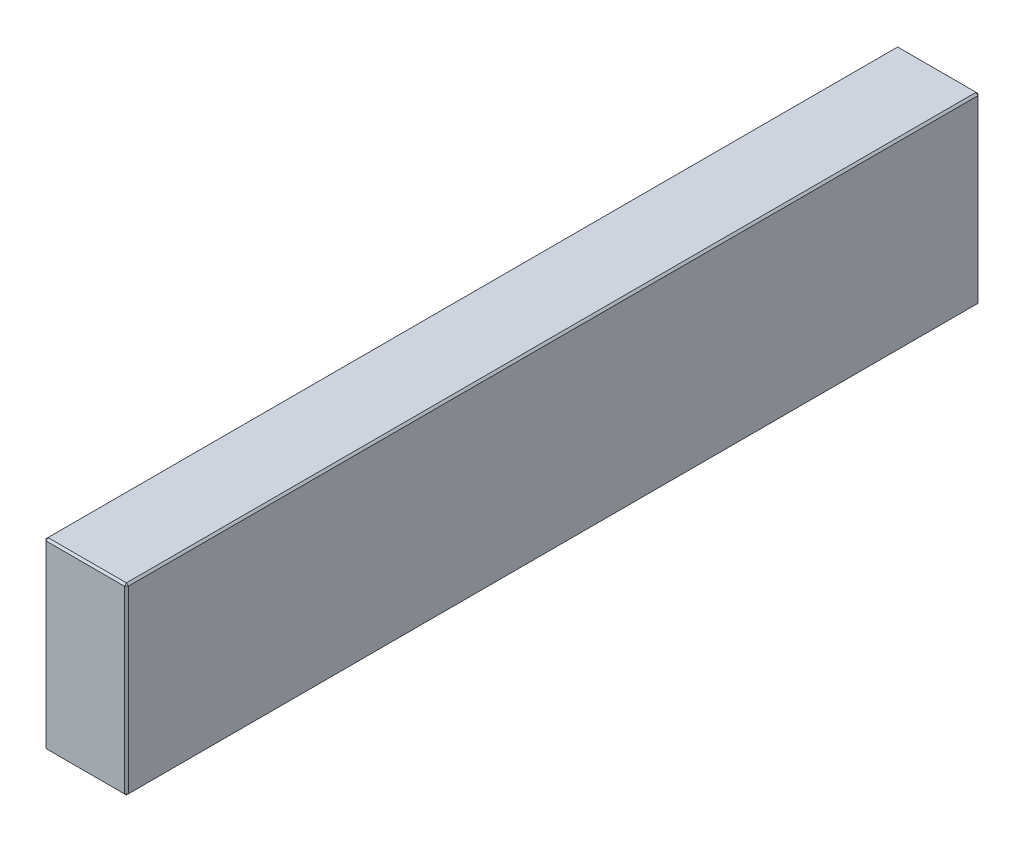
ISO-10303-21;
HEADER;
FILE_DESCRIPTION(('STEP AP214'),'2;1');
FILE_NAME('part.step','',(''),(''),'','','');
FILE_SCHEMA(('AUTOMOTIVE_DESIGN { 1 0 10303 214 1 1 1 1 }'));
ENDSEC;
DATA;
#1=APPLICATION_CONTEXT('core data for automotive mechanical design processes');
#2=APPLICATION_PROTOCOL_DEFINITION('international standard','automotive_design',2000,#1);
#3=PRODUCT_CONTEXT('',#1,'mechanical');
#4=PRODUCT('Part','Part','',(#3));
#5=PRODUCT_RELATED_PRODUCT_CATEGORY('part','',(#4));
#6=PRODUCT_DEFINITION_FORMATION('','',#4);
#7=PRODUCT_DEFINITION_CONTEXT('part definition',#1,'design');
#8=PRODUCT_DEFINITION('design','',#6,#7);
#9=PRODUCT_DEFINITION_SHAPE('','',#8);
#10=(LENGTH_UNIT() NAMED_UNIT(*) SI_UNIT(.MILLI.,.METRE.));
#11=(NAMED_UNIT(*) PLANE_ANGLE_UNIT() SI_UNIT($,.RADIAN.));
#12=(NAMED_UNIT(*) SI_UNIT($,.STERADIAN.) SOLID_ANGLE_UNIT());
#13=UNCERTAINTY_MEASURE_WITH_UNIT(LENGTH_MEASURE(1.E-05),#10,'distance_accuracy_value','');
#14=(GEOMETRIC_REPRESENTATION_CONTEXT(3) GLOBAL_UNCERTAINTY_ASSIGNED_CONTEXT((#13)) GLOBAL_UNIT_ASSIGNED_CONTEXT((#10,
#11,#12)) REPRESENTATION_CONTEXT('',''));
#15=CARTESIAN_POINT('',(0.,0.,0.));
#16=DIRECTION('',(0.,0.,1.));
#17=DIRECTION('',(1.,0.,0.));
#18=AXIS2_PLACEMENT_3D('',#15,#16,#17);
#19=CARTESIAN_POINT('',(-21.5,96.,223.));
#20=DIRECTION('',(1.,0.,0.));
#21=DIRECTION('',(0.,0.,-1.));
#22=AXIS2_PLACEMENT_3D('',#19,#20,#21);
#23=PLANE('',#22);
#24=DIRECTION('',(0.,-1.,0.));
#25=VECTOR('',#24,1.);
#26=CARTESIAN_POINT('',(-21.5,96.,-222.));
#27=LINE('',#26,#25);
#28=CARTESIAN_POINT('',(-21.5,95.,-222.));
#29=VERTEX_POINT('',#28);
#30=CARTESIAN_POINT('',(-21.5,1.00000000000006,-222.));
#31=VERTEX_POINT('',#30);
#32=EDGE_CURVE('E114',#29,#31,#27,.T.);
#33=ORIENTED_EDGE('',*,*,#32,.T.);
#34=DIRECTION('',(0.,0.,1.));
#35=VECTOR('',#34,1.);
#36=CARTESIAN_POINT('',(-21.5,1.00000000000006,223.));
#37=LINE('',#36,#35);
#38=CARTESIAN_POINT('',(-21.5,1.00000000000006,222.));
#39=VERTEX_POINT('',#38);
#40=EDGE_CURVE('E110',#31,#39,#37,.T.);
#41=ORIENTED_EDGE('',*,*,#40,.T.);
#42=DIRECTION('',(0.,1.,0.));
#43=VECTOR('',#42,1.);
#44=CARTESIAN_POINT('',(-21.5,96.,222.));
#45=LINE('',#44,#43);
#46=CARTESIAN_POINT('',(-21.5,95.,222.));
#47=VERTEX_POINT('',#46);
#48=EDGE_CURVE('E103',#39,#47,#45,.T.);
#49=ORIENTED_EDGE('',*,*,#48,.T.);
#50=DIRECTION('',(0.,0.,-1.));
#51=VECTOR('',#50,1.);
#52=CARTESIAN_POINT('',(-21.5,95.,-223.));
#53=LINE('',#52,#51);
#54=EDGE_CURVE('E107',#47,#29,#53,.T.);
#55=ORIENTED_EDGE('',*,*,#54,.T.);
#56=EDGE_LOOP('',(#33,#41,#49,#55));
#57=FACE_BOUND('',#56,.T.);
#58=ADVANCED_FACE('F15',(#57),#23,.F.);
#59=CARTESIAN_POINT('',(21.5,96.,223.));
#60=DIRECTION('',(0.,0.,-1.));
#61=DIRECTION('',(-1.,0.,0.));
#62=AXIS2_PLACEMENT_3D('',#59,#60,#61);
#63=PLANE('',#62);
#64=DIRECTION('',(-1.,0.,0.));
#65=VECTOR('',#64,1.);
#66=CARTESIAN_POINT('',(-21.5,95.,223.));
#67=LINE('',#66,#65);
#68=CARTESIAN_POINT('',(20.5,95.,223.));
#69=VERTEX_POINT('',#68);
#70=CARTESIAN_POINT('',(-20.5,95.,223.));
#71=VERTEX_POINT('',#70);
#72=EDGE_CURVE('E164',#69,#71,#67,.T.);
#73=ORIENTED_EDGE('',*,*,#72,.T.);
#74=DIRECTION('',(0.,-1.,0.));
#75=VECTOR('',#74,1.);
#76=CARTESIAN_POINT('',(-20.5,96.,223.));
#77=LINE('',#76,#75);
#78=CARTESIAN_POINT('',(-20.5,1.00000000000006,223.));
#79=VERTEX_POINT('',#78);
#80=EDGE_CURVE('E122',#71,#79,#77,.T.);
#81=ORIENTED_EDGE('',*,*,#80,.T.);
#82=DIRECTION('',(1.,0.,0.));
#83=VECTOR('',#82,1.);
#84=CARTESIAN_POINT('',(21.5,1.00000000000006,223.));
#85=LINE('',#84,#83);
#86=CARTESIAN_POINT('',(20.5,1.00000000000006,223.));
#87=VERTEX_POINT('',#86);
#88=EDGE_CURVE('E168',#79,#87,#85,.T.);
#89=ORIENTED_EDGE('',*,*,#88,.T.);
#90=DIRECTION('',(0.,1.,0.));
#91=VECTOR('',#90,1.);
#92=CARTESIAN_POINT('',(20.5,96.,223.));
#93=LINE('',#92,#91);
#94=EDGE_CURVE('E166',#87,#69,#93,.T.);
#95=ORIENTED_EDGE('',*,*,#94,.T.);
#96=EDGE_LOOP('',(#73,#81,#89,#95));
#97=FACE_BOUND('',#96,.T.);
#98=ADVANCED_FACE('F275',(#97),#63,.F.);
#99=CARTESIAN_POINT('',(21.5,96.,223.));
#100=DIRECTION('',(-1.,0.,0.));
#101=DIRECTION('',(0.,0.,1.));
#102=AXIS2_PLACEMENT_3D('',#99,#100,#101);
#103=PLANE('',#102);
#104=DIRECTION('',(0.,0.,-1.));
#105=VECTOR('',#104,1.);
#106=CARTESIAN_POINT('',(21.5,1.00000000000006,223.));
#107=LINE('',#106,#105);
#108=CARTESIAN_POINT('',(21.5,1.00000000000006,222.));
#109=VERTEX_POINT('',#108);
#110=CARTESIAN_POINT('',(21.5,1.00000000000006,-222.));
#111=VERTEX_POINT('',#110);
#112=EDGE_CURVE('E159',#109,#111,#107,.T.);
#113=ORIENTED_EDGE('',*,*,#112,.T.);
#114=DIRECTION('',(0.,1.,0.));
#115=VECTOR('',#114,1.);
#116=CARTESIAN_POINT('',(21.5,96.,-222.));
#117=LINE('',#116,#115);
#118=CARTESIAN_POINT('',(21.5,95.,-222.));
#119=VERTEX_POINT('',#118);
#120=EDGE_CURVE('E161',#111,#119,#117,.T.);
#121=ORIENTED_EDGE('',*,*,#120,.T.);
#122=DIRECTION('',(0.,0.,1.));
#123=VECTOR('',#122,1.);
#124=CARTESIAN_POINT('',(21.5,95.,223.));
#125=LINE('',#124,#123);
#126=CARTESIAN_POINT('',(21.5,95.,222.));
#127=VERTEX_POINT('',#126);
#128=EDGE_CURVE('E155',#119,#127,#125,.T.);
#129=ORIENTED_EDGE('',*,*,#128,.T.);
#130=DIRECTION('',(0.,-1.,0.));
#131=VECTOR('',#130,1.);
#132=CARTESIAN_POINT('',(21.5,96.,222.));
#133=LINE('',#132,#131);
#134=EDGE_CURVE('E157',#127,#109,#133,.T.);
#135=ORIENTED_EDGE('',*,*,#134,.T.);
#136=EDGE_LOOP('',(#113,#121,#129,#135));
#137=FACE_BOUND('',#136,.T.);
#138=ADVANCED_FACE('F254',(#137),#103,.F.);
#139=CARTESIAN_POINT('',(21.5,96.,-223.));
#140=DIRECTION('',(0.,0.,1.));
#141=DIRECTION('',(1.,0.,0.));
#142=AXIS2_PLACEMENT_3D('',#139,#140,#141);
#143=PLANE('',#142);
#144=DIRECTION('',(0.,-1.,0.));
#145=VECTOR('',#144,1.);
#146=CARTESIAN_POINT('',(20.5,96.,-223.));
#147=LINE('',#146,#145);
#148=CARTESIAN_POINT('',(20.5,95.,-223.));
#149=VERTEX_POINT('',#148);
#150=CARTESIAN_POINT('',(20.5,1.00000000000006,-223.));
#151=VERTEX_POINT('',#150);
#152=EDGE_CURVE('E148',#149,#151,#147,.T.);
#153=ORIENTED_EDGE('',*,*,#152,.T.);
#154=DIRECTION('',(-1.,0.,0.));
#155=VECTOR('',#154,1.);
#156=CARTESIAN_POINT('',(21.5,1.00000000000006,-223.));
#157=LINE('',#156,#155);
#158=CARTESIAN_POINT('',(-20.5,1.00000000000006,-223.));
#159=VERTEX_POINT('',#158);
#160=EDGE_CURVE('E153',#151,#159,#157,.T.);
#161=ORIENTED_EDGE('',*,*,#160,.T.);
#162=DIRECTION('',(0.,1.,0.));
#163=VECTOR('',#162,1.);
#164=CARTESIAN_POINT('',(-20.5,96.,-223.));
#165=LINE('',#164,#163);
#166=CARTESIAN_POINT('',(-20.5,95.,-223.));
#167=VERTEX_POINT('',#166);
#168=EDGE_CURVE('E150',#159,#167,#165,.T.);
#169=ORIENTED_EDGE('',*,*,#168,.T.);
#170=DIRECTION('',(1.,0.,0.));
#171=VECTOR('',#170,1.);
#172=CARTESIAN_POINT('',(21.5,95.,-223.));
#173=LINE('',#172,#171);
#174=EDGE_CURVE('E146',#167,#149,#173,.T.);
#175=ORIENTED_EDGE('',*,*,#174,.T.);
#176=EDGE_LOOP('',(#153,#161,#169,#175));
#177=FACE_BOUND('',#176,.T.);
#178=ADVANCED_FACE('F284',(#177),#143,.F.);
#179=CARTESIAN_POINT('',(0.,96.,0.));
#180=DIRECTION('',(0.,1.,0.));
#181=DIRECTION('',(0.,0.,1.));
#182=AXIS2_PLACEMENT_3D('',#179,#180,#181);
#183=PLANE('',#182);
#184=DIRECTION('',(0.,0.,-1.));
#185=VECTOR('',#184,1.);
#186=CARTESIAN_POINT('',(20.5,96.,-223.));
#187=LINE('',#186,#185);
#188=CARTESIAN_POINT('',(20.5,96.,222.));
#189=VERTEX_POINT('',#188);
#190=CARTESIAN_POINT('',(20.5,96.,-222.));
#191=VERTEX_POINT('',#190);
#192=EDGE_CURVE('E24',#189,#191,#187,.T.);
#193=ORIENTED_EDGE('',*,*,#192,.T.);
#194=DIRECTION('',(-1.,0.,0.));
#195=VECTOR('',#194,1.);
#196=CARTESIAN_POINT('',(-21.5,96.,-222.));
#197=LINE('',#196,#195);
#198=CARTESIAN_POINT('',(-20.5,96.,-222.));
#199=VERTEX_POINT('',#198);
#200=EDGE_CURVE('E9',#191,#199,#197,.T.);
#201=ORIENTED_EDGE('',*,*,#200,.T.);
#202=DIRECTION('',(0.,0.,1.));
#203=VECTOR('',#202,1.);
#204=CARTESIAN_POINT('',(-20.5,96.,223.));
#205=LINE('',#204,#203);
#206=CARTESIAN_POINT('',(-20.5,96.,222.));
#207=VERTEX_POINT('',#206);
#208=EDGE_CURVE('E180',#199,#207,#205,.T.);
#209=ORIENTED_EDGE('',*,*,#208,.T.);
#210=DIRECTION('',(1.,0.,0.));
#211=VECTOR('',#210,1.);
#212=CARTESIAN_POINT('',(21.5,96.,222.));
#213=LINE('',#212,#211);
#214=EDGE_CURVE('E35',#207,#189,#213,.T.);
#215=ORIENTED_EDGE('',*,*,#214,.T.);
#216=EDGE_LOOP('',(#193,#201,#209,#215));
#217=FACE_BOUND('',#216,.T.);
#218=ADVANCED_FACE('F350',(#217),#183,.T.);
#219=CARTESIAN_POINT('',(0.,0.,0.));
#220=DIRECTION('',(0.,1.,0.));
#221=DIRECTION('',(0.,0.,1.));
#222=AXIS2_PLACEMENT_3D('',#219,#220,#221);
#223=PLANE('',#222);
#224=DIRECTION('',(0.,0.,1.));
#225=VECTOR('',#224,1.);
#226=CARTESIAN_POINT('',(20.5,0.,0.));
#227=LINE('',#226,#225);
#228=CARTESIAN_POINT('',(20.5,0.,-222.));
#229=VERTEX_POINT('',#228);
#230=CARTESIAN_POINT('',(20.5,0.,222.));
#231=VERTEX_POINT('',#230);
#232=EDGE_CURVE('E171',#229,#231,#227,.T.);
#233=ORIENTED_EDGE('',*,*,#232,.T.);
#234=DIRECTION('',(-1.,0.,0.));
#235=VECTOR('',#234,1.);
#236=CARTESIAN_POINT('',(0.,0.,222.));
#237=LINE('',#236,#235);
#238=CARTESIAN_POINT('',(-20.5,0.,222.));
#239=VERTEX_POINT('',#238);
#240=EDGE_CURVE('E177',#231,#239,#237,.T.);
#241=ORIENTED_EDGE('',*,*,#240,.T.);
#242=DIRECTION('',(0.,0.,-1.));
#243=VECTOR('',#242,1.);
#244=CARTESIAN_POINT('',(-20.5,0.,0.));
#245=LINE('',#244,#243);
#246=CARTESIAN_POINT('',(-20.5,0.,-222.));
#247=VERTEX_POINT('',#246);
#248=EDGE_CURVE('E175',#239,#247,#245,.T.);
#249=ORIENTED_EDGE('',*,*,#248,.T.);
#250=DIRECTION('',(1.,0.,0.));
#251=VECTOR('',#250,1.);
#252=CARTESIAN_POINT('',(0.,0.,-222.));
#253=LINE('',#252,#251);
#254=EDGE_CURVE('E173',#247,#229,#253,.T.);
#255=ORIENTED_EDGE('',*,*,#254,.T.);
#256=EDGE_LOOP('',(#233,#241,#249,#255));
#257=FACE_BOUND('',#256,.T.);
#258=ADVANCED_FACE('F246',(#257),#223,.F.);
#259=CARTESIAN_POINT('',(21.5,96.,222.));
#260=DIRECTION('',(-0.707106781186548,0.,-0.707106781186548));
#261=DIRECTION('',(0.,-1.,0.));
#262=AXIS2_PLACEMENT_3D('',#259,#260,#261);
#263=PLANE('',#262);
#264=DIRECTION('',(-0.707106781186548,0.,0.707106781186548));
#265=VECTOR('',#264,1.);
#266=CARTESIAN_POINT('',(20.5,95.,223.));
#267=LINE('',#266,#265);
#268=EDGE_CURVE('E19',#69,#127,#267,.F.);
#269=ORIENTED_EDGE('',*,*,#268,.F.);
#270=ORIENTED_EDGE('',*,*,#94,.F.);
#271=DIRECTION('',(0.707106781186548,0.,-0.707106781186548));
#272=VECTOR('',#271,1.);
#273=CARTESIAN_POINT('',(20.5,1.00000000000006,223.));
#274=LINE('',#273,#272);
#275=EDGE_CURVE('E142',#109,#87,#274,.F.);
#276=ORIENTED_EDGE('',*,*,#275,.F.);
#277=ORIENTED_EDGE('',*,*,#134,.F.);
#278=EDGE_LOOP('',(#269,#270,#276,#277));
#279=FACE_BOUND('',#278,.T.);
#280=ADVANCED_FACE('F17',(#279),#263,.F.);
#281=CARTESIAN_POINT('',(20.5,95.,223.));
#282=DIRECTION('',(0.577350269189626,0.577350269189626,0.577350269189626));
#283=DIRECTION('',(0.707106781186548,0.,-0.707106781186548));
#284=AXIS2_PLACEMENT_3D('',#281,#282,#283);
#285=PLANE('',#284);
#286=DIRECTION('',(0.,-0.707106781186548,0.707106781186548));
#287=VECTOR('',#286,1.);
#288=CARTESIAN_POINT('',(20.5,95.,223.));
#289=LINE('',#288,#287);
#290=EDGE_CURVE('E226',#69,#189,#289,.F.);
#291=ORIENTED_EDGE('',*,*,#290,.F.);
#292=ORIENTED_EDGE('',*,*,#268,.T.);
#293=DIRECTION('',(-0.707106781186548,0.707106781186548,0.));
#294=VECTOR('',#293,1.);
#295=CARTESIAN_POINT('',(21.,95.5,222.));
#296=LINE('',#295,#294);
#297=EDGE_CURVE('E228',#189,#127,#296,.F.);
#298=ORIENTED_EDGE('',*,*,#297,.F.);
#299=EDGE_LOOP('',(#291,#292,#298));
#300=FACE_BOUND('',#299,.T.);
#301=ADVANCED_FACE('F270',(#300),#285,.T.);
#302=CARTESIAN_POINT('',(20.5,1.00000000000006,223.));
#303=DIRECTION('',(0.577350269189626,-0.577350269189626,0.577350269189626));
#304=DIRECTION('',(0.707106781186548,0.,-0.707106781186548));
#305=AXIS2_PLACEMENT_3D('',#302,#303,#304);
#306=PLANE('',#305);
#307=DIRECTION('',(-0.707106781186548,-0.707106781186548,0.));
#308=VECTOR('',#307,1.);
#309=CARTESIAN_POINT('',(21.,0.500000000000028,222.));
#310=LINE('',#309,#308);
#311=EDGE_CURVE('E220',#109,#231,#310,.T.);
#312=ORIENTED_EDGE('',*,*,#311,.F.);
#313=ORIENTED_EDGE('',*,*,#275,.T.);
#314=DIRECTION('',(0.,0.707106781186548,0.707106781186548));
#315=VECTOR('',#314,1.);
#316=CARTESIAN_POINT('',(20.5,1.00000000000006,223.));
#317=LINE('',#316,#315);
#318=EDGE_CURVE('E223',#231,#87,#317,.T.);
#319=ORIENTED_EDGE('',*,*,#318,.F.);
#320=EDGE_LOOP('',(#312,#313,#319));
#321=FACE_BOUND('',#320,.T.);
#322=ADVANCED_FACE('F235',(#321),#306,.T.);
#323=CARTESIAN_POINT('',(20.5,96.,0.));
#324=DIRECTION('',(0.707106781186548,0.707106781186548,0.));
#325=DIRECTION('',(0.,0.,1.));
#326=AXIS2_PLACEMENT_3D('',#323,#324,#325);
#327=PLANE('',#326);
#328=ORIENTED_EDGE('',*,*,#297,.T.);
#329=ORIENTED_EDGE('',*,*,#128,.F.);
#330=DIRECTION('',(0.707106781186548,-0.707106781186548,0.));
#331=VECTOR('',#330,1.);
#332=CARTESIAN_POINT('',(21.5,95.,-222.));
#333=LINE('',#332,#331);
#334=EDGE_CURVE('E215',#191,#119,#333,.T.);
#335=ORIENTED_EDGE('',*,*,#334,.F.);
#336=ORIENTED_EDGE('',*,*,#192,.F.);
#337=EDGE_LOOP('',(#328,#329,#335,#336));
#338=FACE_BOUND('',#337,.T.);
#339=ADVANCED_FACE('F265',(#338),#327,.T.);
#340=CARTESIAN_POINT('',(0.,96.,222.));
#341=DIRECTION('',(0.,0.707106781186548,0.707106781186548));
#342=DIRECTION('',(-1.,0.,0.));
#343=AXIS2_PLACEMENT_3D('',#340,#341,#342);
#344=PLANE('',#343);
#345=ORIENTED_EDGE('',*,*,#290,.T.);
#346=ORIENTED_EDGE('',*,*,#214,.F.);
#347=DIRECTION('',(0.,0.707106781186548,-0.707106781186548));
#348=VECTOR('',#347,1.);
#349=CARTESIAN_POINT('',(-20.5,95.5,222.5));
#350=LINE('',#349,#348);
#351=EDGE_CURVE('E126',#71,#207,#350,.T.);
#352=ORIENTED_EDGE('',*,*,#351,.F.);
#353=ORIENTED_EDGE('',*,*,#72,.F.);
#354=EDGE_LOOP('',(#345,#346,#352,#353));
#355=FACE_BOUND('',#354,.T.);
#356=ADVANCED_FACE('F273',(#355),#344,.T.);
#357=CARTESIAN_POINT('',(-20.5,96.,223.));
#358=DIRECTION('',(0.707106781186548,0.,-0.707106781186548));
#359=DIRECTION('',(0.,-1.,0.));
#360=AXIS2_PLACEMENT_3D('',#357,#358,#359);
#361=PLANE('',#360);
#362=DIRECTION('',(0.707106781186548,0.,0.707106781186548));
#363=VECTOR('',#362,1.);
#364=CARTESIAN_POINT('',(-20.5,1.00000000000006,223.));
#365=LINE('',#364,#363);
#366=EDGE_CURVE('E127',#79,#39,#365,.F.);
#367=ORIENTED_EDGE('',*,*,#366,.F.);
#368=ORIENTED_EDGE('',*,*,#80,.F.);
#369=DIRECTION('',(-0.707106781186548,0.,-0.707106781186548));
#370=VECTOR('',#369,1.);
#371=CARTESIAN_POINT('',(-21.5,95.,222.));
#372=LINE('',#371,#370);
#373=EDGE_CURVE('E118',#47,#71,#372,.F.);
#374=ORIENTED_EDGE('',*,*,#373,.F.);
#375=ORIENTED_EDGE('',*,*,#48,.F.);
#376=EDGE_LOOP('',(#367,#368,#374,#375));
#377=FACE_BOUND('',#376,.T.);
#378=ADVANCED_FACE('F120',(#377),#361,.F.);
#379=CARTESIAN_POINT('',(21.5,1.00000000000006,223.));
#380=DIRECTION('',(0.,0.707106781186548,-0.707106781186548));
#381=DIRECTION('',(1.,0.,0.));
#382=AXIS2_PLACEMENT_3D('',#379,#380,#381);
#383=PLANE('',#382);
#384=ORIENTED_EDGE('',*,*,#318,.T.);
#385=ORIENTED_EDGE('',*,*,#88,.F.);
#386=DIRECTION('',(0.,-0.707106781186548,-0.707106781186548));
#387=VECTOR('',#386,1.);
#388=CARTESIAN_POINT('',(-20.5,1.00000000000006,223.));
#389=LINE('',#388,#387);
#390=EDGE_CURVE('E211',#239,#79,#389,.F.);
#391=ORIENTED_EDGE('',*,*,#390,.F.);
#392=ORIENTED_EDGE('',*,*,#240,.F.);
#393=EDGE_LOOP('',(#384,#385,#391,#392));
#394=FACE_BOUND('',#393,.T.);
#395=ADVANCED_FACE('F243',(#394),#383,.F.);
#396=CARTESIAN_POINT('',(21.5,1.00000000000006,223.));
#397=DIRECTION('',(-0.707106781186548,0.707106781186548,0.));
#398=DIRECTION('',(0.,0.,-1.));
#399=AXIS2_PLACEMENT_3D('',#396,#397,#398);
#400=PLANE('',#399);
#401=ORIENTED_EDGE('',*,*,#311,.T.);
#402=ORIENTED_EDGE('',*,*,#232,.F.);
#403=DIRECTION('',(0.707106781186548,0.707106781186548,0.));
#404=VECTOR('',#403,1.);
#405=CARTESIAN_POINT('',(21.,0.500000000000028,-222.));
#406=LINE('',#405,#404);
#407=EDGE_CURVE('E208',#111,#229,#406,.F.);
#408=ORIENTED_EDGE('',*,*,#407,.F.);
#409=ORIENTED_EDGE('',*,*,#112,.F.);
#410=EDGE_LOOP('',(#401,#402,#408,#409));
#411=FACE_BOUND('',#410,.T.);
#412=ADVANCED_FACE('F251',(#411),#400,.F.);
#413=CARTESIAN_POINT('',(20.5,96.,-223.));
#414=DIRECTION('',(-0.707106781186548,0.,0.707106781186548));
#415=DIRECTION('',(0.,-1.,0.));
#416=AXIS2_PLACEMENT_3D('',#413,#414,#415);
#417=PLANE('',#416);
#418=DIRECTION('',(0.707106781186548,0.,0.707106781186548));
#419=VECTOR('',#418,1.);
#420=CARTESIAN_POINT('',(21.5,95.,-222.));
#421=LINE('',#420,#419);
#422=EDGE_CURVE('E217',#119,#149,#421,.F.);
#423=ORIENTED_EDGE('',*,*,#422,.F.);
#424=ORIENTED_EDGE('',*,*,#120,.F.);
#425=DIRECTION('',(-0.707106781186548,0.,-0.707106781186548));
#426=VECTOR('',#425,1.);
#427=CARTESIAN_POINT('',(20.5,1.00000000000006,-223.));
#428=LINE('',#427,#426);
#429=EDGE_CURVE('E205',#151,#111,#428,.F.);
#430=ORIENTED_EDGE('',*,*,#429,.F.);
#431=ORIENTED_EDGE('',*,*,#152,.F.);
#432=EDGE_LOOP('',(#423,#424,#430,#431));
#433=FACE_BOUND('',#432,.T.);
#434=ADVANCED_FACE('F258',(#433),#417,.F.);
#435=CARTESIAN_POINT('',(21.5,95.,-222.));
#436=DIRECTION('',(0.577350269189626,0.577350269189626,-0.577350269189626));
#437=DIRECTION('',(-0.707106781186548,0.,-0.707106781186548));
#438=AXIS2_PLACEMENT_3D('',#435,#436,#437);
#439=PLANE('',#438);
#440=ORIENTED_EDGE('',*,*,#334,.T.);
#441=ORIENTED_EDGE('',*,*,#422,.T.);
#442=DIRECTION('',(0.,0.707106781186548,0.707106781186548));
#443=VECTOR('',#442,1.);
#444=CARTESIAN_POINT('',(20.5,95.5,-222.5));
#445=LINE('',#444,#443);
#446=EDGE_CURVE('E134',#191,#149,#445,.F.);
#447=ORIENTED_EDGE('',*,*,#446,.F.);
#448=EDGE_LOOP('',(#440,#441,#447));
#449=FACE_BOUND('',#448,.T.);
#450=ADVANCED_FACE('F325',(#449),#439,.T.);
#451=CARTESIAN_POINT('',(-21.5,95.,222.));
#452=DIRECTION('',(-0.577350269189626,0.577350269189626,0.577350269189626));
#453=DIRECTION('',(0.707106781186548,0.,0.707106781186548));
#454=AXIS2_PLACEMENT_3D('',#451,#452,#453);
#455=PLANE('',#454);
#456=ORIENTED_EDGE('',*,*,#373,.T.);
#457=ORIENTED_EDGE('',*,*,#351,.T.);
#458=DIRECTION('',(-0.707106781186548,-0.707106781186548,0.));
#459=VECTOR('',#458,1.);
#460=CARTESIAN_POINT('',(-21.5,95.,222.));
#461=LINE('',#460,#459);
#462=EDGE_CURVE('E130',#47,#207,#461,.F.);
#463=ORIENTED_EDGE('',*,*,#462,.F.);
#464=EDGE_LOOP('',(#456,#457,#463));
#465=FACE_BOUND('',#464,.T.);
#466=ADVANCED_FACE('F131',(#465),#455,.T.);
#467=CARTESIAN_POINT('',(-20.5,1.00000000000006,223.));
#468=DIRECTION('',(-0.577350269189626,-0.577350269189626,0.577350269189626));
#469=DIRECTION('',(0.707106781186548,0.,0.707106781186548));
#470=AXIS2_PLACEMENT_3D('',#467,#468,#469);
#471=PLANE('',#470);
#472=ORIENTED_EDGE('',*,*,#390,.T.);
#473=ORIENTED_EDGE('',*,*,#366,.T.);
#474=DIRECTION('',(-0.707106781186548,0.707106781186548,0.));
#475=VECTOR('',#474,1.);
#476=CARTESIAN_POINT('',(-21.,0.500000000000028,222.));
#477=LINE('',#476,#475);
#478=EDGE_CURVE('E135',#239,#39,#477,.T.);
#479=ORIENTED_EDGE('',*,*,#478,.F.);
#480=EDGE_LOOP('',(#472,#473,#479));
#481=FACE_BOUND('',#480,.T.);
#482=ADVANCED_FACE('F318',(#481),#471,.T.);
#483=CARTESIAN_POINT('',(20.5,1.00000000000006,-223.));
#484=DIRECTION('',(0.577350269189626,-0.577350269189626,-0.577350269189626));
#485=DIRECTION('',(-0.707106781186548,0.,-0.707106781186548));
#486=AXIS2_PLACEMENT_3D('',#483,#484,#485);
#487=PLANE('',#486);
#488=ORIENTED_EDGE('',*,*,#429,.T.);
#489=ORIENTED_EDGE('',*,*,#407,.T.);
#490=DIRECTION('',(0.,-0.707106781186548,0.707106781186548));
#491=VECTOR('',#490,1.);
#492=CARTESIAN_POINT('',(20.5,1.00000000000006,-223.));
#493=LINE('',#492,#491);
#494=EDGE_CURVE('E198',#151,#229,#493,.T.);
#495=ORIENTED_EDGE('',*,*,#494,.F.);
#496=EDGE_LOOP('',(#488,#489,#495));
#497=FACE_BOUND('',#496,.T.);
#498=ADVANCED_FACE('F314',(#497),#487,.T.);
#499=CARTESIAN_POINT('',(0.,96.,-222.));
#500=DIRECTION('',(0.,0.707106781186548,-0.707106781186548));
#501=DIRECTION('',(1.,0.,0.));
#502=AXIS2_PLACEMENT_3D('',#499,#500,#501);
#503=PLANE('',#502);
#504=ORIENTED_EDGE('',*,*,#446,.T.);
#505=ORIENTED_EDGE('',*,*,#174,.F.);
#506=DIRECTION('',(0.,-0.707106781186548,-0.707106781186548));
#507=VECTOR('',#506,1.);
#508=CARTESIAN_POINT('',(-20.5,95.,-223.));
#509=LINE('',#508,#507);
#510=EDGE_CURVE('E195',#199,#167,#509,.T.);
#511=ORIENTED_EDGE('',*,*,#510,.F.);
#512=ORIENTED_EDGE('',*,*,#200,.F.);
#513=EDGE_LOOP('',(#504,#505,#511,#512));
#514=FACE_BOUND('',#513,.T.);
#515=ADVANCED_FACE('F311',(#514),#503,.T.);
#516=CARTESIAN_POINT('',(-20.5,96.,0.));
#517=DIRECTION('',(-0.707106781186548,0.707106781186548,0.));
#518=DIRECTION('',(0.,0.,-1.));
#519=AXIS2_PLACEMENT_3D('',#516,#517,#518);
#520=PLANE('',#519);
#521=ORIENTED_EDGE('',*,*,#462,.T.);
#522=ORIENTED_EDGE('',*,*,#208,.F.);
#523=DIRECTION('',(0.707106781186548,0.707106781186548,0.));
#524=VECTOR('',#523,1.);
#525=CARTESIAN_POINT('',(-21.,95.5,-222.));
#526=LINE('',#525,#524);
#527=EDGE_CURVE('E138',#29,#199,#526,.T.);
#528=ORIENTED_EDGE('',*,*,#527,.F.);
#529=ORIENTED_EDGE('',*,*,#54,.F.);
#530=EDGE_LOOP('',(#521,#522,#528,#529));
#531=FACE_BOUND('',#530,.T.);
#532=ADVANCED_FACE('F137',(#531),#520,.T.);
#533=CARTESIAN_POINT('',(-21.5,1.00000000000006,223.));
#534=DIRECTION('',(0.707106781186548,0.707106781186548,0.));
#535=DIRECTION('',(0.,0.,1.));
#536=AXIS2_PLACEMENT_3D('',#533,#534,#535);
#537=PLANE('',#536);
#538=ORIENTED_EDGE('',*,*,#478,.T.);
#539=ORIENTED_EDGE('',*,*,#40,.F.);
#540=DIRECTION('',(0.707106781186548,-0.707106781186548,0.));
#541=VECTOR('',#540,1.);
#542=CARTESIAN_POINT('',(-21.5,1.00000000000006,-222.));
#543=LINE('',#542,#541);
#544=EDGE_CURVE('E191',#247,#31,#543,.F.);
#545=ORIENTED_EDGE('',*,*,#544,.F.);
#546=ORIENTED_EDGE('',*,*,#248,.F.);
#547=EDGE_LOOP('',(#538,#539,#545,#546));
#548=FACE_BOUND('',#547,.T.);
#549=ADVANCED_FACE('F304',(#548),#537,.F.);
#550=CARTESIAN_POINT('',(21.5,1.00000000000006,-223.));
#551=DIRECTION('',(0.,0.707106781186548,0.707106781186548));
#552=DIRECTION('',(-1.,0.,0.));
#553=AXIS2_PLACEMENT_3D('',#550,#551,#552);
#554=PLANE('',#553);
#555=ORIENTED_EDGE('',*,*,#494,.T.);
#556=ORIENTED_EDGE('',*,*,#254,.F.);
#557=DIRECTION('',(0.,0.707106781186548,-0.707106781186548));
#558=VECTOR('',#557,1.);
#559=CARTESIAN_POINT('',(-20.5,0.500000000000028,-222.5));
#560=LINE('',#559,#558);
#561=EDGE_CURVE('E188',#159,#247,#560,.F.);
#562=ORIENTED_EDGE('',*,*,#561,.F.);
#563=ORIENTED_EDGE('',*,*,#160,.F.);
#564=EDGE_LOOP('',(#555,#556,#562,#563));
#565=FACE_BOUND('',#564,.T.);
#566=ADVANCED_FACE('F300',(#565),#554,.F.);
#567=CARTESIAN_POINT('',(-20.5,95.,-223.));
#568=DIRECTION('',(-0.577350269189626,0.577350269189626,-0.577350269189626));
#569=DIRECTION('',(-0.707106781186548,0.,0.707106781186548));
#570=AXIS2_PLACEMENT_3D('',#567,#568,#569);
#571=PLANE('',#570);
#572=ORIENTED_EDGE('',*,*,#527,.T.);
#573=ORIENTED_EDGE('',*,*,#510,.T.);
#574=DIRECTION('',(0.707106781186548,0.,-0.707106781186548));
#575=VECTOR('',#574,1.);
#576=CARTESIAN_POINT('',(-20.5,95.,-223.));
#577=LINE('',#576,#575);
#578=EDGE_CURVE('E186',#29,#167,#577,.T.);
#579=ORIENTED_EDGE('',*,*,#578,.F.);
#580=EDGE_LOOP('',(#572,#573,#579));
#581=FACE_BOUND('',#580,.T.);
#582=ADVANCED_FACE('F296',(#581),#571,.T.);
#583=CARTESIAN_POINT('',(-21.5,1.00000000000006,-222.));
#584=DIRECTION('',(-0.577350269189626,-0.577350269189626,-0.577350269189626));
#585=DIRECTION('',(-0.707106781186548,0.,0.707106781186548));
#586=AXIS2_PLACEMENT_3D('',#583,#584,#585);
#587=PLANE('',#586);
#588=ORIENTED_EDGE('',*,*,#561,.T.);
#589=ORIENTED_EDGE('',*,*,#544,.T.);
#590=DIRECTION('',(-0.707106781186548,0.,0.707106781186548));
#591=VECTOR('',#590,1.);
#592=CARTESIAN_POINT('',(-21.5,1.00000000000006,-222.));
#593=LINE('',#592,#591);
#594=EDGE_CURVE('E184',#159,#31,#593,.T.);
#595=ORIENTED_EDGE('',*,*,#594,.F.);
#596=EDGE_LOOP('',(#588,#589,#595));
#597=FACE_BOUND('',#596,.T.);
#598=ADVANCED_FACE('F292',(#597),#587,.T.);
#599=CARTESIAN_POINT('',(-21.5,96.,-222.));
#600=DIRECTION('',(0.707106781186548,0.,0.707106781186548));
#601=DIRECTION('',(0.,-1.,0.));
#602=AXIS2_PLACEMENT_3D('',#599,#600,#601);
#603=PLANE('',#602);
#604=ORIENTED_EDGE('',*,*,#578,.T.);
#605=ORIENTED_EDGE('',*,*,#168,.F.);
#606=ORIENTED_EDGE('',*,*,#594,.T.);
#607=ORIENTED_EDGE('',*,*,#32,.F.);
#608=EDGE_LOOP('',(#604,#605,#606,#607));
#609=FACE_BOUND('',#608,.T.);
#610=ADVANCED_FACE('F289',(#609),#603,.F.);
#611=CLOSED_SHELL('',(#58,#98,#138,#178,#218,#258,#280,#301,#322,#339,#356,#378,#395,#412,#434,
#450,#466,#482,#498,#515,#532,#549,#566,#582,#598,#610));
#612=MANIFOLD_SOLID_BREP('B1',#611);
#613=ADVANCED_BREP_SHAPE_REPRESENTATION('',(#18,#612),#14);
#614=SHAPE_DEFINITION_REPRESENTATION(#9,#613);
ENDSEC;
END-ISO-10303-21;
